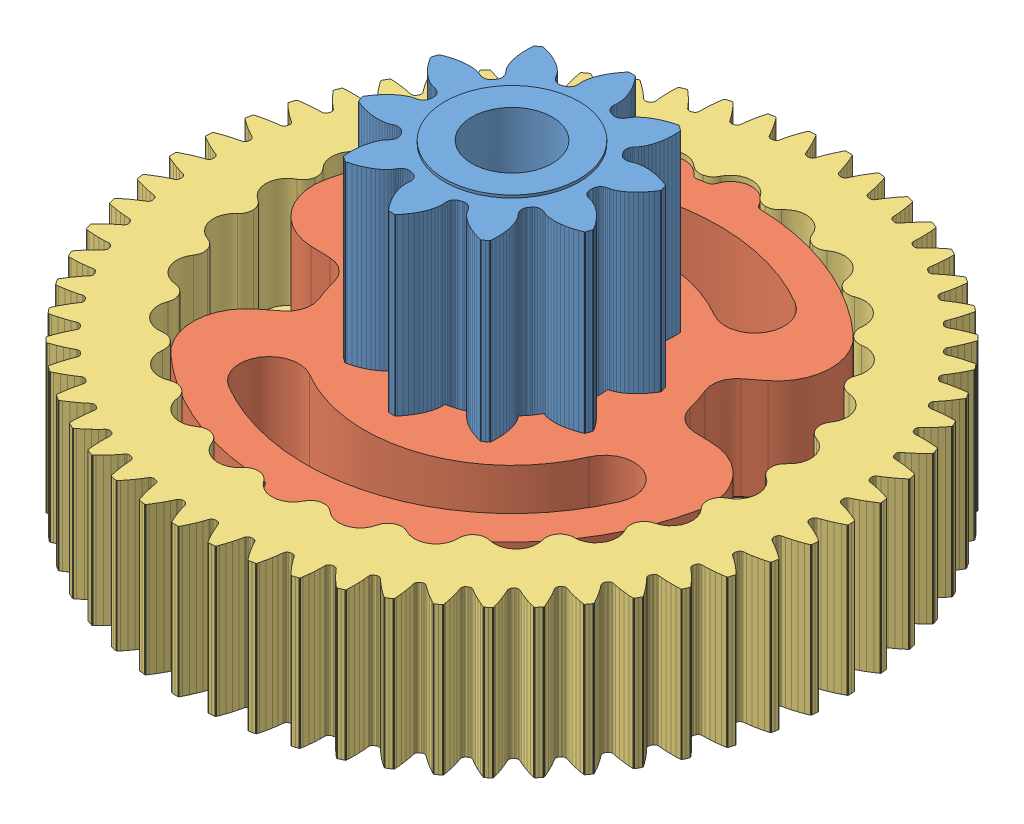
SolidWorks assembly Pignon 2.SLDASM, configuration Défaut (file format 6000). Lengths in mm.
Overall size (28.78 12 28.8).
3 component instances, 3 part files, 6 mates.
Components (placement in the parent):
- ALD_M100068__P_Pinion_inf_4_A00-1: ALD_M100068__P_Pinion_inf_4_A00.sldprt [Default] at (-0.0567 -5.016 10.5) size (8.58 10.5 8.96)
- ALD_M010289__P_Inf_Limiter_Default-1: ALD_M010289__P_Inf_Limiter_Default.sldprt [Default] at (-0.0567 -5.016 10.5) x (0.951057 0 -0.309017) z (0 1 0) size (16.14 19.2 3.9)
- ALD_M010288__P_Inf_Wheel_3&4_A00-1: ALD_M010288__P_Inf_Wheel_3&4_A00.sldprt [Default] at (-0.0567 -6.416 10.5) x (0.98137 0 -0.192127) z (0.192127 0 0.98137) size (24.52 5.6 24.55)
Mates (geometry in assembly coordinates):
- Coïncidente1: coincident: plane of ALD_M100068__P_Pinion_inf_4_A00-1 through (1.4433 -5.016 10.5) normal (0 -1 0); plane of ALD_M010289__P_Inf_Limiter_Default-1 through (-0.0567 -5.016 10.5) normal (0 -1 0)
- Coaxiale1: concentric: cylinder of ALD_M100068__P_Pinion_inf_4_A00-1 through (-0.0567 -1.216 10.5) axis (0 -1 0) radius 4.25; cylinder of ALD_M010289__P_Inf_Limiter_Default-1 through (-0.0567 -18.451 10.5) axis (0 1 0) radius 4.25
- Coïncidente2: coincident anti-aligned: plane of ALD_M100068__P_Pinion_inf_4_A00-1 through (-2.6372 -17.4207 10.6494) normal (-0.998594 0 -0.053008); plane of ALD_M010289__P_Inf_Limiter_Default-1 through (-2.7926 -5.016 13.5773) normal (0.998594 0 0.053008)
- Coïncidente3: coincident: plane of ALD_M010289__P_Inf_Limiter_Default-1 through (-0.0567 -5.016 10.5) normal (0 -1 0); plane of ALD_M010288__P_Inf_Wheel_3&4_A00-1 through (10.6746 -5.016 8.3991) normal (0 1 0)
- Coaxiale2: concentric: cylinder of ALD_M010289__P_Inf_Limiter_Default-1 through (0.5807 -1.116 19.2769) axis (0 -1 0) radius 0.8; cylinder of ALD_M010288__P_Inf_Wheel_3&4_A00-1 through (0.5807 -7.2788 19.2769) axis (0 1 0) radius 0.8
- Coaxiale3: concentric anti-aligned: cylinder of ALD_M010289__P_Inf_Limiter_Default-1 through (-4.7 -1.116 3.0247) axis (0 -1 0) radius 0.8; cylinder of ALD_M010288__P_Inf_Wheel_3&4_A00-1 through (-4.7 -7.2788 3.0247) axis (0 1 0) radius 0.8
